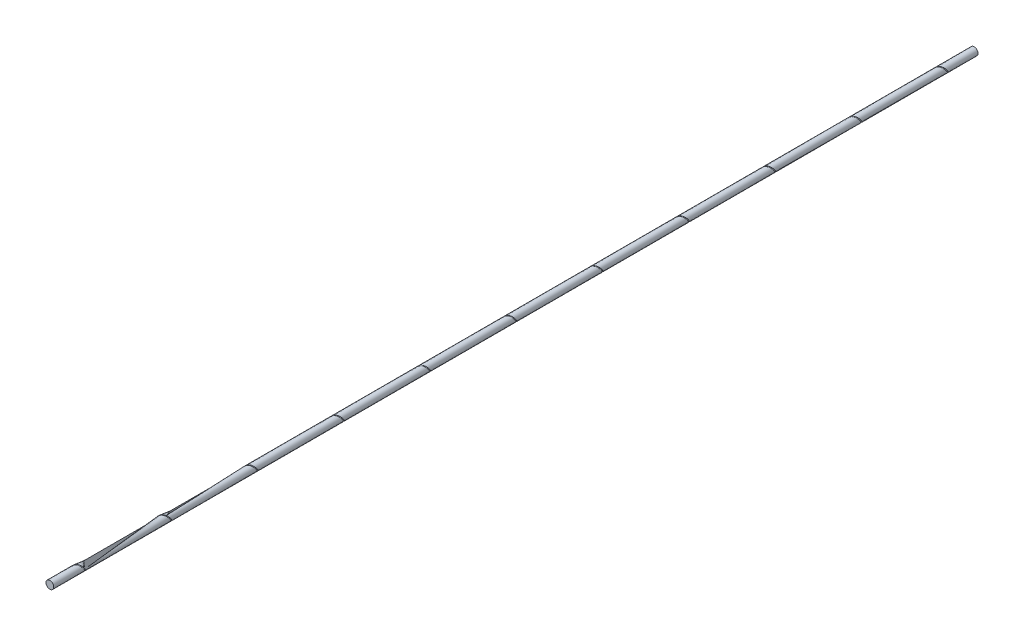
from build123d import *

# Parameters (mm, degrees)
SKETCH1_R              = 25
BOSS_EXTRUDE1_DEPTH    = 6000
CUT_SWEEP1_PITCH       = 100
CUT_SWEEP1_HEIGHT      = 100
CUT_SWEEP1_RADIUS      = 27.646
CUT_SWEEP1_START_ANGLE = -180
SKETCH3_R              = 3.969
LPATTERN1_COUNT        = 11
LPATTERN1_PITCH        = 560


with BuildPart() as part:
    # Sketch1 → Boss-Extrude1 (new body)
    with BuildSketch(Plane.XY):
        Circle(SKETCH1_R)
    extrude(amount=BOSS_EXTRUDE1_DEPTH)

    # Cut-Sweep1: sweep along a helix
    with BuildLine() as cut_sweep1_path:
        add(Helix(CUT_SWEEP1_PITCH, CUT_SWEEP1_HEIGHT, CUT_SWEEP1_RADIUS, center=(0, 0, 150), direction=(0, 0, 1), mode=Mode.PRIVATE).rotate(Axis((0, 0, 150), (0, 0, 1)), CUT_SWEEP1_START_ANGLE))
    # Sketch3 → Cut-Sweep1 (sweep, cut)
    with BuildSketch(Plane(origin=(0, 0, 0), x_dir=(1, 0, 0), z_dir=(0, 1, 0))):
        with Locations((-27.646, -150)):
            Circle(SKETCH3_R)
    cut_sweep1 = sweep(path=cut_sweep1_path.line, is_frenet=True, mode=Mode.SUBTRACT)

    # LPattern1: Cut-Sweep1 ×11
    with Locations(*[(0, 0, i * LPATTERN1_PITCH) for i in range(1, LPATTERN1_COUNT)]):
        add(cut_sweep1, mode=Mode.SUBTRACT)


solid = part.part
